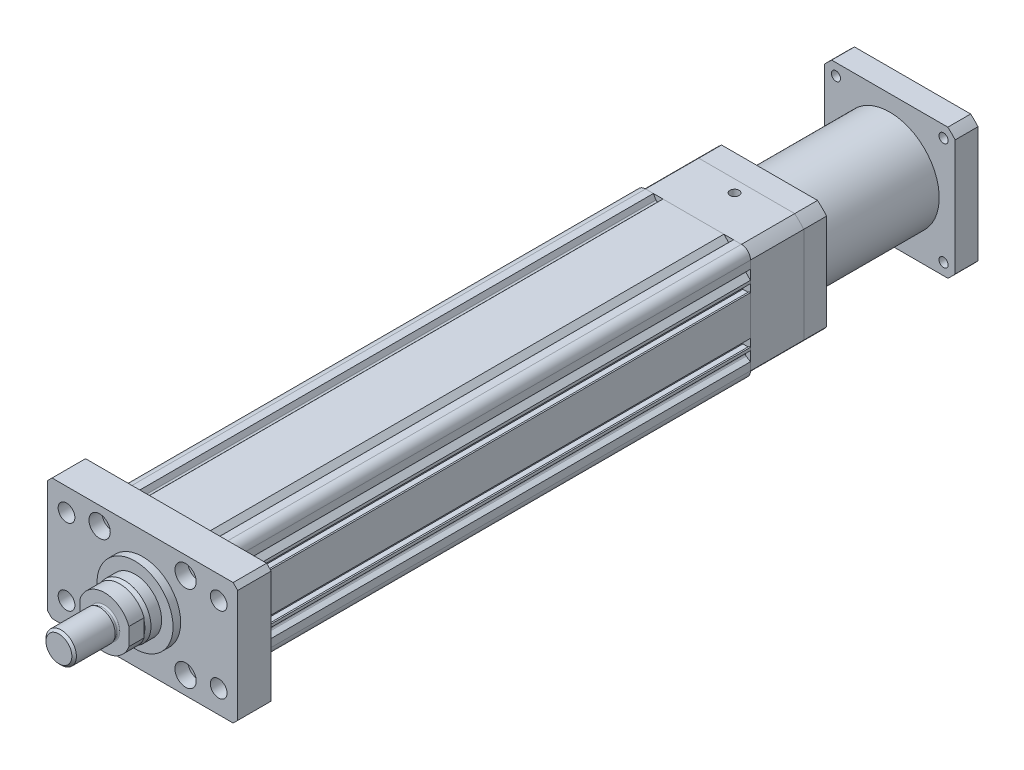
from build123d import *

# Parameters (mm, degrees)
SKETCH_1_R          = 31.5
SKETCH_1_R_2        = 3.35
EXTRUDE_1_DEPTH     = 340
SKETCH_2_R          = 5.5
SKETCH_2_R_2        = 4.25
EXTRUDE_1_2_DEPTH   = 22
SKETCH_3_R          = 7
SKETCH_3_R_2        = 4.25
CUT_EXTRUDE_1_DEPTH = 8.5
SKETCH_3_3_R        = 25
EXTRUDE_2_DEPTH     = 5
SKETCH_5_R          = 17.5
EXTRUDE_3_DEPTH     = 10
CHAMFER_1_SIZE      = 3
CHAMFER_1_SIZE2     = 1
EXTRUDE_4_DEPTH     = 10
SKETCH_8_R          = 9
EXTRUDE_5_DEPTH     = 3
SKETCH_9_R          = 10
EXTRUDE_6_DEPTH     = 27
CHAMFER_2_SIZE      = 1.5
FILLET_1_R          = 1
EXTRUDE_7_DEPTH     = 35
SKETCH_11_R         = 3
CUT_EXTRUDE_2_DEPTH = 5
EXTRUDE_8_DEPTH     = 15
SKETCH_13_R         = 32.5
EXTRUDE_9_DEPTH     = 79
SKETCH_14_R         = 3
EXTRUDE_10_DEPTH    = 15
SKETCH_15_R         = 40
CUT_EXTRUDE_3_DEPTH = 6
SKETCH_15_3_R       = 26
CUT_EXTRUDE_4_DEPTH = 101


with BuildPart() as part:
    # Sketch 1 → Extrude 1 (new body)
    with BuildSketch(Plane.XY):
        with BuildLine():
            Line((-31.5, 37.5), (-26.33, 37.5))
            Line((-26.33, 37.5), (-24.66467188, 34.615567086))
            ThreePointArc((-24.66467188, 34.615567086), (-23.929172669, 34.124122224), (-23.091539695, 34.408460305))
            Line((-23.091539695, 34.408460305), (-20, 37.5))
            Line((-20, 37.5), (20, 37.5))
            Line((20, 37.5), (23.091539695, 34.408460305))
            ThreePointArc((23.091539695, 34.408460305), (23.929172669, 34.124122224), (24.66467188, 34.615567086))
            Line((24.66467188, 34.615567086), (26.33, 37.5))
            Line((26.33, 37.5), (31.5, 37.5))
            ThreePointArc((31.5, 37.5), (35.742640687, 35.742640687), (37.5, 31.5))
            Line((37.5, 31.5), (37.5, 26.33))
            Line((37.5, 26.33), (34.615567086, 24.66467188))
            ThreePointArc((34.615567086, 24.66467188), (34.124122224, 23.929172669), (34.408460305, 23.091539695))
            Line((34.408460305, 23.091539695), (37.5, 20))
            Line((37.5, 20), (37.5, 18.1))
            Line((37.5, 18.1), (36.5, 18.1))
            Line((36.5, 18.1), (36.5, 18.7))
            Line((36.5, 18.7), (32.5, 18.7))
            Line((32.5, 18.7), (32.5, 12.4))
            Line((32.5, 12.4), (36.5, 12.4))
            Line((36.5, 12.4), (36.5, 13))
            Line((36.5, 13), (37.5, 13))
            Line((37.5, 13), (37.5, -13))
            Line((37.5, -13), (36.5, -13))
            Line((36.5, -13), (36.5, -12.4))
            Line((36.5, -12.4), (32.5, -12.4))
            Line((32.5, -12.4), (32.5, -18.7))
            Line((32.5, -18.7), (36.5, -18.7))
            Line((36.5, -18.7), (36.5, -18.1))
            Line((36.5, -18.1), (37.5, -18.1))
            Line((37.5, -18.1), (37.5, -20))
            Line((37.5, -20), (34.408460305, -23.091539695))
            ThreePointArc((34.408460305, -23.091539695), (34.124122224, -23.929172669), (34.615567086, -24.66467188))
            Line((34.615567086, -24.66467188), (37.5, -26.33))
            Line((37.5, -26.33), (37.5, -31.5))
            ThreePointArc((37.5, -31.5), (35.742640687, -35.742640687), (31.5, -37.5))
            Line((31.5, -37.5), (26.33, -37.5))
            Line((26.33, -37.5), (24.66467188, -34.615567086))
            ThreePointArc((24.66467188, -34.615567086), (23.929172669, -34.124122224), (23.091539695, -34.408460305))
            Line((23.091539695, -34.408460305), (20, -37.5))
            Line((20, -37.5), (18.1, -37.5))
            Line((18.1, -37.5), (18.1, -36.5))
            Line((18.1, -36.5), (18.7, -36.5))
            Line((18.7, -36.5), (18.7, -33.945032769))
            Line((18.7, -33.945032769), (12.4, -33.945032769))
            Line((12.4, -33.945032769), (12.4, -36.5))
            Line((12.4, -36.5), (13, -36.5))
            Line((13, -36.5), (13, -37.5))
            Line((13, -37.5), (-13, -37.5))
            Line((-13, -37.5), (-13, -36.5))
            Line((-13, -36.5), (-12.4, -36.5))
            Line((-12.4, -36.5), (-12.4, -33.945032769))
            Line((-12.4, -33.945032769), (-18.7, -33.945032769))
            Line((-18.7, -33.945032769), (-18.7, -36.5))
            Line((-18.7, -36.5), (-18.1, -36.5))
            Line((-18.1, -36.5), (-18.1, -37.5))
            Line((-18.1, -37.5), (-20, -37.5))
            Line((-20, -37.5), (-23.091539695, -34.408460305))
            ThreePointArc((-23.091539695, -34.408460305), (-23.929172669, -34.124122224), (-24.66467188, -34.615567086))
            Line((-24.66467188, -34.615567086), (-26.33, -37.5))
            Line((-26.33, -37.5), (-31.5, -37.5))
            ThreePointArc((-31.5, -37.5), (-35.742640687, -35.742640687), (-37.5, -31.5))
            Line((-37.5, -31.5), (-37.5, -26.33))
            Line((-37.5, -26.33), (-34.615567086, -24.66467188))
            ThreePointArc((-34.615567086, -24.66467188), (-34.124122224, -23.929172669), (-34.408460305, -23.091539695))
            Line((-34.408460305, -23.091539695), (-37.5, -20))
            Line((-37.5, -20), (-37.5, -18.1))
            Line((-37.5, -18.1), (-36.5, -18.1))
            Line((-36.5, -18.1), (-36.5, -18.7))
            Line((-36.5, -18.7), (-32.5, -18.7))
            Line((-32.5, -18.7), (-32.5, -12.4))
            Line((-32.5, -12.4), (-36.5, -12.4))
            Line((-36.5, -12.4), (-36.5, -13))
            Line((-36.5, -13), (-37.5, -13))
            Line((-37.5, -13), (-37.5, 13))
            Line((-37.5, 13), (-36.5, 13))
            Line((-36.5, 13), (-36.5, 12.4))
            Line((-36.5, 12.4), (-32.5, 12.4))
            Line((-32.5, 12.4), (-32.5, 18.7))
            Line((-32.5, 18.7), (-36.5, 18.7))
            Line((-36.5, 18.7), (-36.5, 18.1))
            Line((-36.5, 18.1), (-37.5, 18.1))
            Line((-37.5, 18.1), (-37.5, 20))
            Line((-37.5, 20), (-34.408460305, 23.091539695))
            ThreePointArc((-34.408460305, 23.091539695), (-34.124122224, 23.929172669), (-34.615567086, 24.66467188))
            Line((-34.615567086, 24.66467188), (-37.5, 26.33))
            Line((-37.5, 26.33), (-37.5, 31.5))
            ThreePointArc((-37.5, 31.5), (-35.742640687, 35.742640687), (-31.5, 37.5))
        make_face()
        Circle(SKETCH_1_R, mode=Mode.SUBTRACT)
        with Locations((-28.25, 28.25)):
            Circle(SKETCH_1_R_2, mode=Mode.SUBTRACT)
        with Locations(Location((28.25, 28.25, 0), (0, 0, 180))):
            Circle(SKETCH_1_R_2, mode=Mode.SUBTRACT)
        with Locations((28.25, -28.25)):
            Circle(SKETCH_1_R_2, mode=Mode.SUBTRACT)
        with Locations(Location((-28.25, -28.25, 0), (0, 0, 180))):
            Circle(SKETCH_1_R_2, mode=Mode.SUBTRACT)
    extrude(amount=EXTRUDE_1_DEPTH)


with BuildPart() as body_2:
    # Sketch 2 → Extrude 1 2 (new body)
    with BuildSketch(Plane.XY.offset(340)):
        Polygon((-62.5, 37), (-59.5, 40), (59.5, 40), (62.5, 37), (62.5, -37), (59.5, -40), (-59.5, -40), (-62.5, -37), align=None)
        with Locations((-50, 25)):
            Circle(SKETCH_2_R, mode=Mode.SUBTRACT)
        with Locations((-28.25, 28.25)):
            Circle(SKETCH_2_R_2, mode=Mode.SUBTRACT)
        with Locations(Location((28.25, 28.25, 0), (0, 0, 180))):
            Circle(SKETCH_2_R_2, mode=Mode.SUBTRACT)
        with Locations(Location((50, 25, 0), (0, 0, 180))):
            Circle(SKETCH_2_R, mode=Mode.SUBTRACT)
        with Locations(Location((-50, -25, 0), (0, 0, 180))):
            Circle(SKETCH_2_R, mode=Mode.SUBTRACT)
        with Locations(Location((-28.25, -28.25, 0), (0, 0, 180))):
            Circle(SKETCH_2_R_2, mode=Mode.SUBTRACT)
        with Locations((50, -25)):
            Circle(SKETCH_2_R, mode=Mode.SUBTRACT)
        with Locations((28.25, -28.25)):
            Circle(SKETCH_2_R_2, mode=Mode.SUBTRACT)
    extrude(amount=EXTRUDE_1_2_DEPTH)

    # Sketch 3 → Cut-Extrude 1 (cut)
    # profile 1 of 4: a face of its own
    with BuildSketch(Plane.XY.offset(362)):
        with Locations((28.25, -28.25)):
            Circle(SKETCH_3_R)
        with Locations((28.25, -28.25)):
            Circle(SKETCH_3_R_2, mode=Mode.SUBTRACT)
    # profile 2 of 4: a face of its own
    with BuildSketch(Plane.XY.offset(362)):
        with Locations((-28.25, -28.25)):
            Circle(SKETCH_3_R)
        with Locations(Location((-28.25, -28.25, 0), (0, 0, 180))):
            Circle(SKETCH_3_R_2, mode=Mode.SUBTRACT)
    # profile 3 of 4: a face of its own
    with BuildSketch(Plane.XY.offset(362)):
        with Locations((-28.25, 28.25)):
            Circle(SKETCH_3_R)
    # profile 4 of 4: a face of its own
    with BuildSketch(Plane.XY.offset(362)):
        with Locations((28.25, 28.25)):
            Circle(SKETCH_3_R)
    extrude(amount=-CUT_EXTRUDE_1_DEPTH, mode=Mode.SUBTRACT)

    # Sketch 3_3 → Extrude 2 (add)
    with BuildSketch(Plane.XY.offset(362)):
        Circle(SKETCH_3_3_R)
    extrude(amount=EXTRUDE_2_DEPTH)

    # Sketch 5 → Extrude 3 (add)
    with BuildSketch(Plane.XY.offset(367)):
        Circle(SKETCH_5_R)
    extrude(amount=EXTRUDE_3_DEPTH)

    # Chamfer 1
    chamfer_1_edges = [body_2.edges().sort_by_distance(p)[0] for p in [
        (-17.5, 0, 377),
    ]]
    chamfer_1_side = [body_2.faces().sort_by_distance(p)[0] for p in [
        (-17.5, 0, 372),
    ]]
    chamfer(chamfer_1_edges, length=CHAMFER_1_SIZE, length2=CHAMFER_1_SIZE2, reference=chamfer_1_side[0])

    # Sketch 6 → Extrude 4 (add)
    with BuildSketch(Plane.XY.offset(377)):
        with BuildLine():
            Line((-16, 5.744562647), (-16, -5.744562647))
            ThreePointArc((-16, -5.744562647), (0, -17), (16, -5.744562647))
            Line((16, -5.744562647), (16, 5.744562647))
            ThreePointArc((16, 5.744562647), (0, 17), (-16, 5.744562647))
        make_face()
    extrude(amount=EXTRUDE_4_DEPTH)

    # Sketch 8 → Extrude 5 (add)
    with BuildSketch(Plane.XY.offset(387)):
        Circle(SKETCH_8_R)
    extrude(amount=EXTRUDE_5_DEPTH)

    # Sketch 9 → Extrude 6 (add)
    with BuildSketch(Plane.XY.offset(390)):
        Circle(SKETCH_9_R)
    extrude(amount=EXTRUDE_6_DEPTH)

    # Chamfer 2
    chamfer_2_edges = [body_2.edges().sort_by_distance(p)[0] for p in [
        (-10, 0, 417),
    ]]
    chamfer(chamfer_2_edges, length=CHAMFER_2_SIZE)

    # Fillet 1
    fillet_1_edges = [body_2.edges().sort_by_distance(p)[0] for p in [
        (-9, 0, 387),
    ]]
    fillet(fillet_1_edges, radius=FILLET_1_R)


with BuildPart() as body_3:
    # Sketch 10 → Extrude 7 (new body)
    with BuildSketch(Plane(origin=(0, 0, 0), x_dir=(-1, 0, 0), z_dir=(0, 0, -1))):
        with BuildLine():
            Line((-31.539657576, 37.5), (31.539657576, 37.5))
            ThreePointArc((31.539657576, 37.5), (34.648232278, 34.648232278), (37.5, 31.539657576))
            Line((37.5, 31.539657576), (37.5, -31.539657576))
            ThreePointArc((37.5, -31.539657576), (34.648232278, -34.648232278), (31.539657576, -37.5))
            Line((31.539657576, -37.5), (-31.539657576, -37.5))
            ThreePointArc((-31.539657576, -37.5), (-34.648232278, -34.648232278), (-37.5, -31.539657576))
            Line((-37.5, -31.539657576), (-37.5, 31.539657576))
            ThreePointArc((-37.5, 31.539657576), (-34.648232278, 34.648232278), (-31.539657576, 37.5))
        make_face()
    extrude(amount=EXTRUDE_7_DEPTH)

    # Sketch 11 → Cut-Extrude 2 (cut)
    with BuildSketch(Plane(origin=(0, 37.5, 0), x_dir=(1, 0, 0), z_dir=(0, 1, 0))):
        with Locations(Location((0, 27, 0), (0, 0, 270))):
            Circle(SKETCH_11_R)
    extrude(amount=-CUT_EXTRUDE_2_DEPTH, mode=Mode.SUBTRACT)


with BuildPart() as body_4:
    # Sketch 12 → Extrude 8 (new body)
    with BuildSketch(Plane(origin=(0, 0, -35), x_dir=(-1, 0, 0), z_dir=(0, 0, -1))):
        with BuildLine():
            Line((-31.539657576, 37.5), (31.539657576, 37.5))
            ThreePointArc((31.539657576, 37.5), (34.648232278, 34.648232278), (37.5, 31.539657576))
            Line((37.5, 31.539657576), (37.5, -31.539657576))
            ThreePointArc((37.5, -31.539657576), (34.648232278, -34.648232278), (31.539657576, -37.5))
            Line((31.539657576, -37.5), (-31.539657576, -37.5))
            ThreePointArc((-31.539657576, -37.5), (-34.648232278, -34.648232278), (-37.5, -31.539657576))
            Line((-37.5, -31.539657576), (-37.5, 31.539657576))
            ThreePointArc((-37.5, 31.539657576), (-34.648232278, 34.648232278), (-31.539657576, 37.5))
        make_face()
    extrude(amount=EXTRUDE_8_DEPTH)

    # Sketch 13 → Extrude 9 (add)
    with BuildSketch(Plane(origin=(0, 0, -50), x_dir=(-1, 0, 0), z_dir=(0, 0, -1))):
        Circle(SKETCH_13_R)
    extrude(amount=EXTRUDE_9_DEPTH)

    # Sketch 14 → Extrude 10 (add)
    with BuildSketch(Plane(origin=(0, 0, -129), x_dir=(-1, 0, 0), z_dir=(0, 0, -1))):
        with BuildLine():
            Line((-38.173943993, 43), (38.173943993, 43))
            ThreePointArc((38.173943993, 43), (40.658639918, 40.658639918), (43, 38.173943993))
            Line((43, 38.173943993), (43, -38.173943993))
            ThreePointArc((43, -38.173943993), (40.658639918, -40.658639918), (38.173943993, -43))
            Line((38.173943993, -43), (-38.173943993, -43))
            ThreePointArc((-38.173943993, -43), (-40.658639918, -40.658639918), (-43, -38.173943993))
            Line((-43, -38.173943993), (-43, 38.173943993))
            ThreePointArc((-43, 38.173943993), (-40.658639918, 40.658639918), (-38.173943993, 43))
        make_face()
        with Locations((-35.355339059, 35.355339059)):
            Circle(SKETCH_14_R, mode=Mode.SUBTRACT)
        with Locations((35.355339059, 35.355339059)):
            Circle(SKETCH_14_R, mode=Mode.SUBTRACT)
        with Locations((35.355339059, -35.355339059)):
            Circle(SKETCH_14_R, mode=Mode.SUBTRACT)
        with Locations((-35.355339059, -35.355339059)):
            Circle(SKETCH_14_R, mode=Mode.SUBTRACT)
    extrude(amount=EXTRUDE_10_DEPTH)

    # Sketch 15 → Cut-Extrude 3 (cut)
    with BuildSketch(Plane(origin=(0, 0, -144), x_dir=(-1, 0, 0), z_dir=(0, 0, -1))):
        Circle(SKETCH_15_R)
    extrude(amount=-CUT_EXTRUDE_3_DEPTH, mode=Mode.SUBTRACT)

    # Sketch 15_3 → Cut-Extrude 4 (cut)
    with BuildSketch(Plane(origin=(0, 0, -144), x_dir=(-1, 0, 0), z_dir=(0, 0, -1))):
        Circle(SKETCH_15_3_R)
    extrude(amount=-CUT_EXTRUDE_4_DEPTH, mode=Mode.SUBTRACT)


solid = Compound([part.part, body_2.part, body_3.part, body_4.part])
